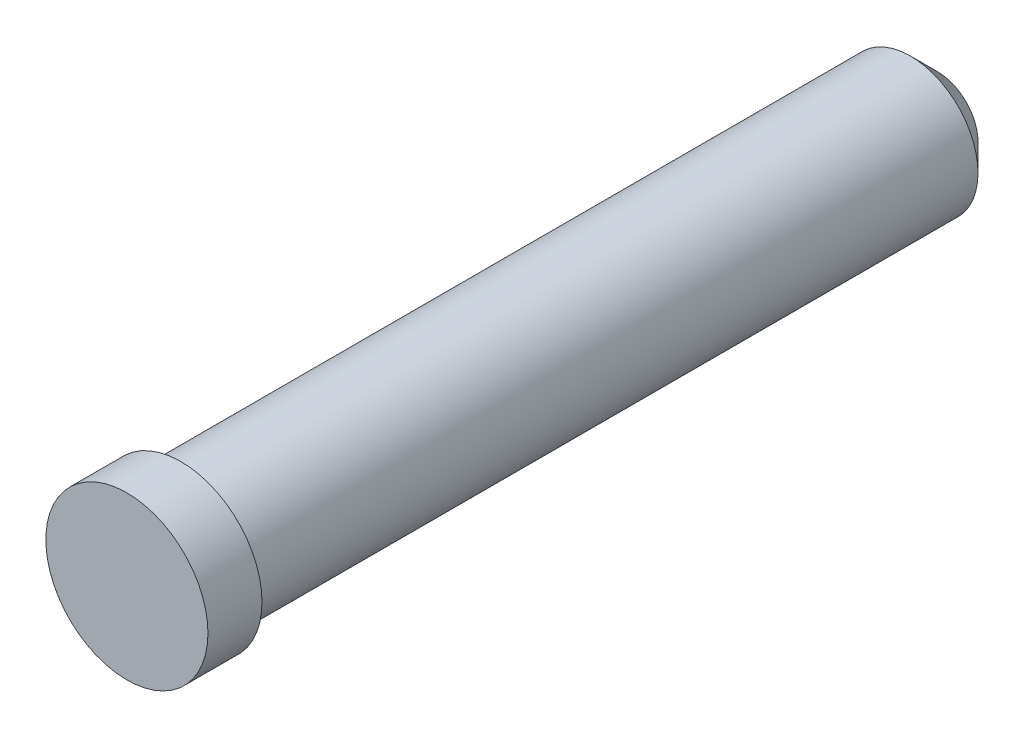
ISO-10303-21;
HEADER;
FILE_DESCRIPTION(('STEP AP214'),'2;1');
FILE_NAME('part.step','',(''),(''),'','','');
FILE_SCHEMA(('AUTOMOTIVE_DESIGN { 1 0 10303 214 1 1 1 1 }'));
ENDSEC;
DATA;
#1=APPLICATION_CONTEXT('core data for automotive mechanical design processes');
#2=APPLICATION_PROTOCOL_DEFINITION('international standard','automotive_design',2000,#1);
#3=PRODUCT_CONTEXT('',#1,'mechanical');
#4=PRODUCT('Part','Part','',(#3));
#5=PRODUCT_RELATED_PRODUCT_CATEGORY('part','',(#4));
#6=PRODUCT_DEFINITION_FORMATION('','',#4);
#7=PRODUCT_DEFINITION_CONTEXT('part definition',#1,'design');
#8=PRODUCT_DEFINITION('design','',#6,#7);
#9=PRODUCT_DEFINITION_SHAPE('','',#8);
#10=(LENGTH_UNIT() NAMED_UNIT(*) SI_UNIT(.MILLI.,.METRE.));
#11=(NAMED_UNIT(*) PLANE_ANGLE_UNIT() SI_UNIT($,.RADIAN.));
#12=(NAMED_UNIT(*) SI_UNIT($,.STERADIAN.) SOLID_ANGLE_UNIT());
#13=UNCERTAINTY_MEASURE_WITH_UNIT(LENGTH_MEASURE(1.E-05),#10,'distance_accuracy_value','');
#14=(GEOMETRIC_REPRESENTATION_CONTEXT(3) GLOBAL_UNCERTAINTY_ASSIGNED_CONTEXT((#13)) GLOBAL_UNIT_ASSIGNED_CONTEXT((#10,
#11,#12)) REPRESENTATION_CONTEXT('',''));
#15=CARTESIAN_POINT('',(0.,0.,0.));
#16=DIRECTION('',(0.,0.,1.));
#17=DIRECTION('',(1.,0.,0.));
#18=AXIS2_PLACEMENT_3D('',#15,#16,#17);
#19=CARTESIAN_POINT('',(0.,0.,28.));
#20=DIRECTION('',(0.,0.,-1.));
#21=DIRECTION('',(-1.,0.,0.));
#22=AXIS2_PLACEMENT_3D('',#19,#20,#21);
#23=CYLINDRICAL_SURFACE('',#22,2.5);
#24=CARTESIAN_POINT('',(0.,0.,1.00000000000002));
#25=DIRECTION('',(0.,0.,1.));
#26=DIRECTION('',(1.,0.,0.));
#27=AXIS2_PLACEMENT_3D('',#24,#25,#26);
#28=CIRCLE('',#27,2.5);
#29=CARTESIAN_POINT('',(2.5,0.,1.00000000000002));
#30=VERTEX_POINT('',#29);
#31=EDGE_CURVE('E36',#30,#30,#28,.T.);
#32=ORIENTED_EDGE('',*,*,#31,.T.);
#33=EDGE_LOOP('',(#32));
#34=FACE_BOUND('',#33,.T.);
#35=CARTESIAN_POINT('',(0.,0.,28.));
#36=DIRECTION('',(0.,0.,1.));
#37=DIRECTION('',(1.,0.,0.));
#38=AXIS2_PLACEMENT_3D('',#35,#36,#37);
#39=CIRCLE('',#38,2.5);
#40=CARTESIAN_POINT('',(2.5,0.,28.));
#41=VERTEX_POINT('',#40);
#42=EDGE_CURVE('E40',#41,#41,#39,.T.);
#43=ORIENTED_EDGE('',*,*,#42,.F.);
#44=EDGE_LOOP('',(#43));
#45=FACE_BOUND('',#44,.T.);
#46=ADVANCED_FACE('F30',(#34,#45),#23,.T.);
#47=CARTESIAN_POINT('',(0.,0.,0.));
#48=DIRECTION('',(0.,0.,1.));
#49=DIRECTION('',(1.,0.,0.));
#50=AXIS2_PLACEMENT_3D('',#47,#48,#49);
#51=PLANE('',#50);
#52=CARTESIAN_POINT('',(0.,0.,0.));
#53=DIRECTION('',(0.,0.,1.));
#54=DIRECTION('',(1.,0.,0.));
#55=AXIS2_PLACEMENT_3D('',#52,#53,#54);
#56=CIRCLE('',#55,1.49999999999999);
#57=CARTESIAN_POINT('',(1.49999999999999,0.,0.));
#58=VERTEX_POINT('',#57);
#59=EDGE_CURVE('E10',#58,#58,#56,.F.);
#60=ORIENTED_EDGE('',*,*,#59,.T.);
#61=EDGE_LOOP('',(#60));
#62=FACE_BOUND('',#61,.T.);
#63=ADVANCED_FACE('F58',(#62),#51,.F.);
#64=CARTESIAN_POINT('',(0.,0.,28.));
#65=DIRECTION('',(0.,0.,1.));
#66=DIRECTION('',(1.,0.,0.));
#67=AXIS2_PLACEMENT_3D('',#64,#65,#66);
#68=PLANE('',#67);
#69=CARTESIAN_POINT('',(0.,0.,28.));
#70=DIRECTION('',(0.,0.,1.));
#71=DIRECTION('',(1.,0.,0.));
#72=AXIS2_PLACEMENT_3D('',#69,#70,#71);
#73=CIRCLE('',#72,3.);
#74=CARTESIAN_POINT('',(3.,0.,28.));
#75=VERTEX_POINT('',#74);
#76=EDGE_CURVE('E49',#75,#75,#73,.T.);
#77=ORIENTED_EDGE('',*,*,#76,.F.);
#78=EDGE_LOOP('',(#77));
#79=FACE_BOUND('',#78,.T.);
#80=ORIENTED_EDGE('',*,*,#42,.T.);
#81=EDGE_LOOP('',(#80));
#82=FACE_BOUND('',#81,.T.);
#83=ADVANCED_FACE('F55',(#79,#82),#68,.F.);
#84=CARTESIAN_POINT('',(0.,0.,30.));
#85=DIRECTION('',(0.,0.,-1.));
#86=DIRECTION('',(-1.,0.,0.));
#87=AXIS2_PLACEMENT_3D('',#84,#85,#86);
#88=CYLINDRICAL_SURFACE('',#87,3.);
#89=CARTESIAN_POINT('',(0.,0.,30.));
#90=DIRECTION('',(0.,0.,1.));
#91=DIRECTION('',(1.,0.,0.));
#92=AXIS2_PLACEMENT_3D('',#89,#90,#91);
#93=CIRCLE('',#92,3.);
#94=CARTESIAN_POINT('',(3.,0.,30.));
#95=VERTEX_POINT('',#94);
#96=EDGE_CURVE('E44',#95,#95,#93,.T.);
#97=ORIENTED_EDGE('',*,*,#96,.F.);
#98=EDGE_LOOP('',(#97));
#99=FACE_BOUND('',#98,.T.);
#100=ORIENTED_EDGE('',*,*,#76,.T.);
#101=EDGE_LOOP('',(#100));
#102=FACE_BOUND('',#101,.T.);
#103=ADVANCED_FACE('F53',(#99,#102),#88,.T.);
#104=CARTESIAN_POINT('',(0.,0.,30.));
#105=DIRECTION('',(0.,0.,1.));
#106=DIRECTION('',(1.,0.,0.));
#107=AXIS2_PLACEMENT_3D('',#104,#105,#106);
#108=PLANE('',#107);
#109=ORIENTED_EDGE('',*,*,#96,.T.);
#110=EDGE_LOOP('',(#109));
#111=FACE_BOUND('',#110,.T.);
#112=ADVANCED_FACE('F71',(#111),#108,.T.);
#113=CARTESIAN_POINT('',(0.,0.,1.00000000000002));
#114=DIRECTION('',(0.,0.,1.));
#115=DIRECTION('',(1.,0.,0.));
#116=AXIS2_PLACEMENT_3D('',#113,#114,#115);
#117=CONICAL_SURFACE('',#116,2.5,0.785398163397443);
#118=ORIENTED_EDGE('',*,*,#59,.F.);
#119=EDGE_LOOP('',(#118));
#120=FACE_BOUND('',#119,.T.);
#121=ORIENTED_EDGE('',*,*,#31,.F.);
#122=EDGE_LOOP('',(#121));
#123=FACE_BOUND('',#122,.T.);
#124=ADVANCED_FACE('F74',(#120,#123),#117,.T.);
#125=CLOSED_SHELL('',(#46,#63,#83,#103,#112,#124));
#126=MANIFOLD_SOLID_BREP('B2',#125);
#127=ADVANCED_BREP_SHAPE_REPRESENTATION('',(#18,#126),#14);
#128=SHAPE_DEFINITION_REPRESENTATION(#9,#127);
ENDSEC;
END-ISO-10303-21;
